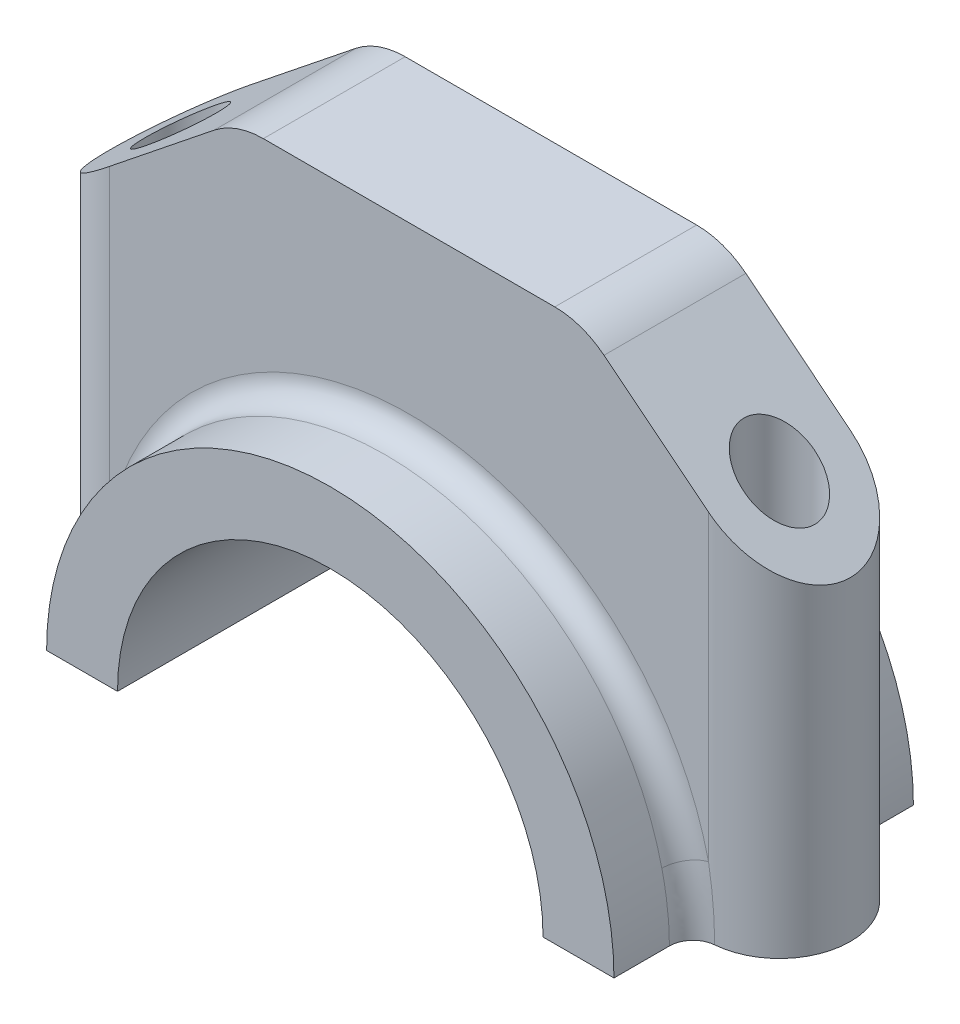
from build123d import *

# Parameters (mm, degrees)
BOSS_EXTRUDE1_DEPTH     = 19
BOSS_EXTRUDE2_REACH     = 74.505
CUT_EXTRUDE1_DEPTH      = 82.197290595
CUT_EXTRUDE1_DEPTH_BACK = 82.197290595
CUT_EXTRUDE2_DEPTH      = 79.549347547
CUT_EXTRUDE2_DEPTH_BACK = 79.549347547
SKETCH4_R               = 4.5
CUT_EXTRUDE6_DEPTH      = 79.549347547
CUT_EXTRUDE6_DEPTH_BACK = 79.549347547
FILLET1_R               = 10
FILLET2_R               = 3


with BuildPart() as part:
    # Sketch1 → Boss-Extrude1 (new, symmetric)
    with BuildSketch(Plane.XY):
        with BuildLine():
            Line((-36, 0), (-27, 0))
            ThreePointArc((-27, 0), (0, 27), (27, 0))
            Line((27, 0), (36, 0))
            ThreePointArc((36, 0), (0, 36), (-36, 0))
        make_face()
    extrude(amount=BOSS_EXTRUDE1_DEPTH, both=True)

    # Boss-Extrude2: up to this face of the body (flat: up to its plane)
    boss_extrude2_end = Plane(part.part.faces().sort_by_distance((-31.5, 0, 0))[0])
    # Sketch2 → Boss-Extrude2 (add, up to the picked face)
    with BuildSketch(Plane(origin=(0, 60, 0), x_dir=(-1, 0, 0), z_dir=(0, -1, 0)), mode=Mode.PRIVATE) as boss_extrude2_sk1:
        with BuildLine():
            Line((38, -9), (-38, -9))
            ThreePointArc((-38, -9), (-47, 0), (-38, 9))
            Line((-38, 9), (38, 9))
            ThreePointArc((38, 9), (47, 0), (38, -9))
        make_face()
    boss_extrude2_tool1 = split(extrude(boss_extrude2_sk1.sketch, amount=BOSS_EXTRUDE2_REACH, mode=Mode.PRIVATE), bisect_by=boss_extrude2_end, keep=Keep.BOTH, mode=Mode.PRIVATE)
    add(boss_extrude2_tool1.solids().sort_by(Axis((0, 60, 0), (0, -1, 0)))[0])

    # Sketch3 → Cut-Extrude1 (cut, two sides: drawn at the far end of the back side and taken through both)
    with BuildSketch(Plane(origin=(0, 0, -9), x_dir=(-1, 0, 0), z_dir=(0, 0, -1)).offset(-CUT_EXTRUDE1_DEPTH_BACK)):
        with BuildLine():
            Line((-27, 0), (27, 0))
            ThreePointArc((27, 0), (0, 27), (-27, 0))
        make_face()
    extrude(amount=CUT_EXTRUDE1_DEPTH + CUT_EXTRUDE1_DEPTH_BACK, mode=Mode.SUBTRACT)

    # Sketch4 → Cut-Extrude2 (cut, two sides: drawn at the far end of the back side and taken through both)
    with BuildSketch(Plane.XZ.offset(-CUT_EXTRUDE2_DEPTH_BACK)):
        with Locations(Location((38, 0, 0), (0, 0, 270))):
            Circle(SKETCH4_R)
        with Locations(Location((-38, 0, 0), (0, 0, 270))):
            Circle(SKETCH4_R)
    extrude(amount=CUT_EXTRUDE2_DEPTH + CUT_EXTRUDE2_DEPTH_BACK, mode=Mode.SUBTRACT)

    # Sketch5 → Cut-Extrude6 (cut, two sides: drawn at the far end of the back side and taken through both)
    with BuildSketch(Plane.XY.offset(-CUT_EXTRUDE6_DEPTH_BACK)):
        Polygon((-47, 40), (-22, 60), (-47, 60), align=None)
        Polygon((47, 60), (47, 40), (22, 60), align=None)
    extrude(amount=CUT_EXTRUDE6_DEPTH + CUT_EXTRUDE6_DEPTH_BACK, mode=Mode.SUBTRACT)

    # Fillet1
    fillet1_edges = [part.edges().sort_by_distance(p)[0] for p in [
        (-22, 60, 0),
        (22, 60, 0),
    ]]
    fillet(fillet1_edges, radius=FILLET1_R)

    # Fillet2
    fillet2_edges = [part.edges().sort_by_distance(p)[0] for p in [
        (0, 36, -9),
        (0, 36, 9),
    ]]
    fillet(fillet2_edges, radius=FILLET2_R)


solid = part.part
